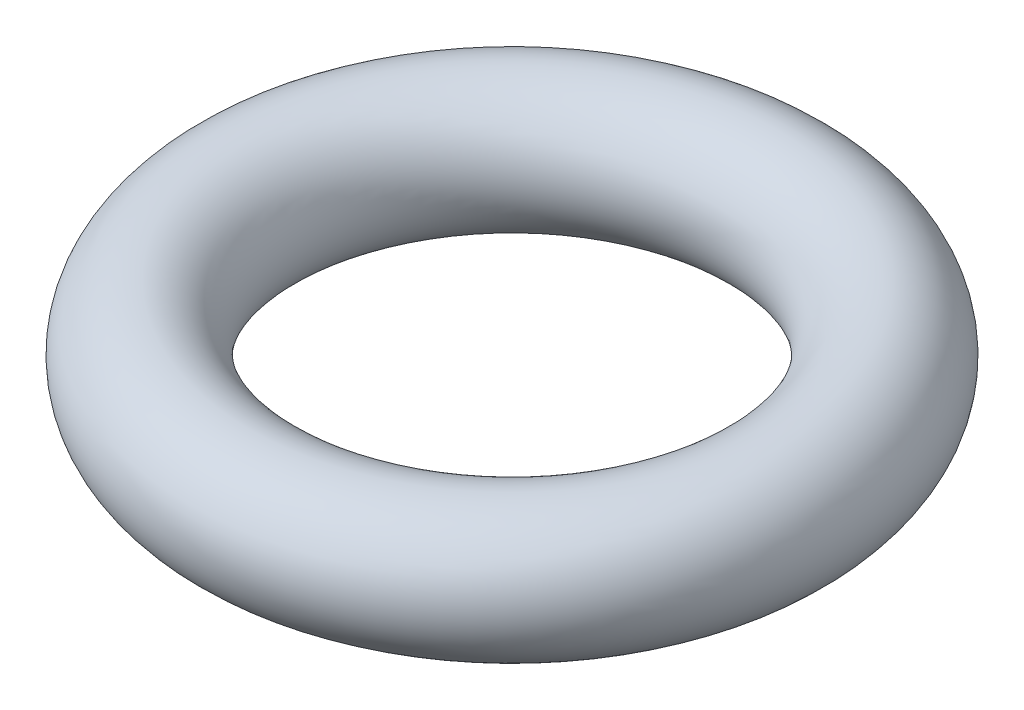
from build123d import *

# Parameters (mm, degrees)
SKETCH1_R = 0.75


with BuildPart() as part:
    # Sketch1 → Revolve1 (revolve)
    with BuildSketch(Plane.XY, mode=Mode.PRIVATE) as revolve1_sk:
        with Locations((-3, 0)):
            Circle(SKETCH1_R)
    revolve(revolve1_sk.sketch.rotate(Axis((0, 0, 0), (0, 1, 0)), 270), axis=Axis((0, 0, 0), (0, 1, 0)))


solid = part.part
